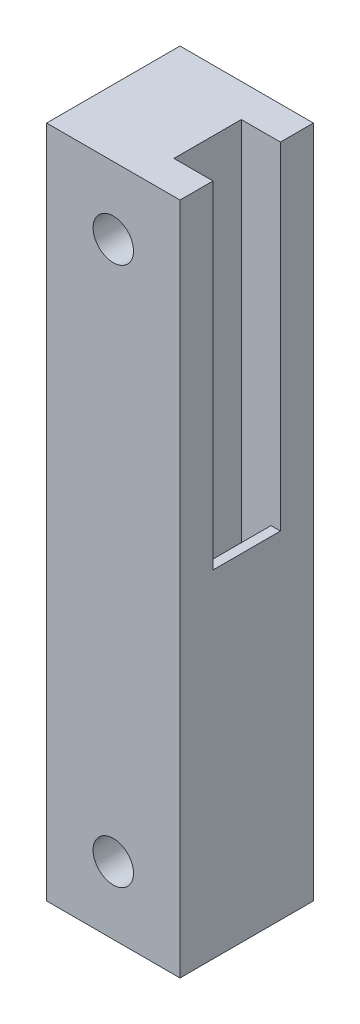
from build123d import *

# Parameters (mm, degrees)
SKETCH_1_W         = 9.9
SKETCH_1_H         = 9.9
SKETCH_1_W_2       = 2.2
SKETCH_1_H_2       = 5
EXTRUDE_1_DEPTH    = 50
SKETCH2_R          = 1.5
CUT_EXTRUDE2_DEPTH = 52.293393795
SKETCH4_W          = 2.9
SKETCH4_H          = 5
CUT_EXTRUDE4_DEPTH = 25


with BuildPart() as part:
    # Sketch 1 → Extrude 1 (new body)
    with BuildSketch(Plane(origin=(0, 0, 0), x_dir=(1, 0, 0), z_dir=(0, 1, 0))):
        with Locations((-0.794758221, -0.10825854)):
            Rectangle(SKETCH_1_W, SKETCH_1_H)
        with Locations((2.355241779, -0.10825854)):
            Rectangle(SKETCH_1_W_2, SKETCH_1_H_2, mode=Mode.SUBTRACT)
    extrude(amount=EXTRUDE_1_DEPTH)

    # Sketch2 → Cut-Extrude2 (cut, through all)
    with BuildSketch(Plane(origin=(0, 0, -4.84174146), x_dir=(-1, 0, 0), z_dir=(0, 0, -1))):
        with Locations((0.794758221, 45)):
            Circle(SKETCH2_R)
        with Locations((0.794758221, 5)):
            Circle(SKETCH2_R)
    extrude(amount=-CUT_EXTRUDE2_DEPTH, mode=Mode.SUBTRACT)

    # Sketch4 → Cut-Extrude4 (cut)
    with BuildSketch(Plane(origin=(0, 50, 0), x_dir=(1, 0, 0), z_dir=(0, 1, 0))):
        with Locations((2.705241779, -0.10825854)):
            Rectangle(SKETCH4_W, SKETCH4_H)
    extrude(amount=-CUT_EXTRUDE4_DEPTH, mode=Mode.SUBTRACT)


solid = part.part
